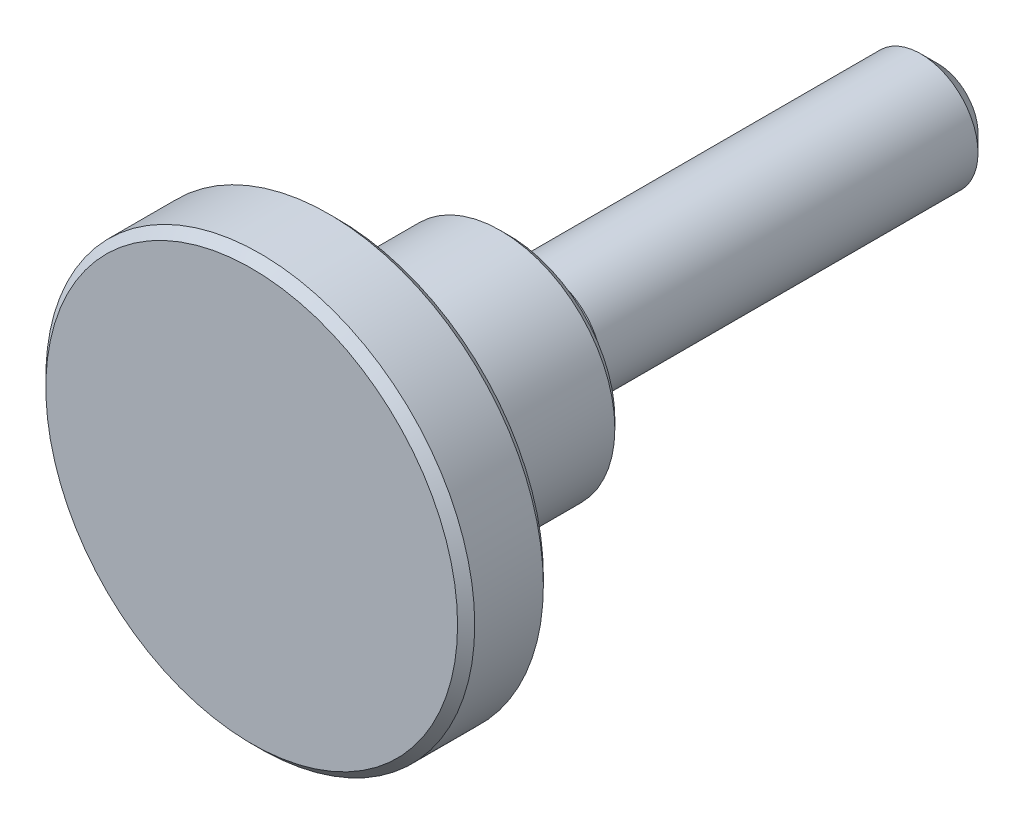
ISO-10303-21;
HEADER;
FILE_DESCRIPTION(('STEP AP214'),'2;1');
FILE_NAME('part.step','',(''),(''),'','','');
FILE_SCHEMA(('AUTOMOTIVE_DESIGN { 1 0 10303 214 1 1 1 1 }'));
ENDSEC;
DATA;
#1=APPLICATION_CONTEXT('core data for automotive mechanical design processes');
#2=APPLICATION_PROTOCOL_DEFINITION('international standard','automotive_design',2000,#1);
#3=PRODUCT_CONTEXT('',#1,'mechanical');
#4=PRODUCT('Part','Part','',(#3));
#5=PRODUCT_RELATED_PRODUCT_CATEGORY('part','',(#4));
#6=PRODUCT_DEFINITION_FORMATION('','',#4);
#7=PRODUCT_DEFINITION_CONTEXT('part definition',#1,'design');
#8=PRODUCT_DEFINITION('design','',#6,#7);
#9=PRODUCT_DEFINITION_SHAPE('','',#8);
#10=(LENGTH_UNIT() NAMED_UNIT(*) SI_UNIT(.MILLI.,.METRE.));
#11=(NAMED_UNIT(*) PLANE_ANGLE_UNIT() SI_UNIT($,.RADIAN.));
#12=(NAMED_UNIT(*) SI_UNIT($,.STERADIAN.) SOLID_ANGLE_UNIT());
#13=UNCERTAINTY_MEASURE_WITH_UNIT(LENGTH_MEASURE(1.E-05),#10,'distance_accuracy_value','');
#14=(GEOMETRIC_REPRESENTATION_CONTEXT(3) GLOBAL_UNCERTAINTY_ASSIGNED_CONTEXT((#13)) GLOBAL_UNIT_ASSIGNED_CONTEXT((#10,
#11,#12)) REPRESENTATION_CONTEXT('',''));
#15=CARTESIAN_POINT('',(0.,0.,0.));
#16=DIRECTION('',(0.,0.,1.));
#17=DIRECTION('',(1.,0.,0.));
#18=AXIS2_PLACEMENT_3D('',#15,#16,#17);
#19=CARTESIAN_POINT('',(0.,2.8,-30.));
#20=DIRECTION('',(0.,0.,1.));
#21=DIRECTION('',(1.,0.,0.));
#22=AXIS2_PLACEMENT_3D('',#19,#20,#21);
#23=PLANE('',#22);
#24=CARTESIAN_POINT('',(0.,0.,-30.));
#25=DIRECTION('',(0.,0.,1.));
#26=DIRECTION('',(1.,0.,0.));
#27=AXIS2_PLACEMENT_3D('',#24,#25,#26);
#28=CIRCLE('',#27,2.8);
#29=CARTESIAN_POINT('',(2.8,0.,-30.));
#30=VERTEX_POINT('',#29);
#31=EDGE_CURVE('E8',#30,#30,#28,.T.);
#32=ORIENTED_EDGE('',*,*,#31,.F.);
#33=EDGE_LOOP('',(#32));
#34=FACE_BOUND('',#33,.T.);
#35=ADVANCED_FACE('F12',(#34),#23,.F.);
#36=CARTESIAN_POINT('',(0.,0.,-30.));
#37=DIRECTION('',(0.,0.,1.));
#38=DIRECTION('',(1.,0.,0.));
#39=AXIS2_PLACEMENT_3D('',#36,#37,#38);
#40=CONICAL_SURFACE('',#39,2.8,0.785398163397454);
#41=CARTESIAN_POINT('',(0.,0.,-28.8));
#42=DIRECTION('',(0.,0.,1.));
#43=DIRECTION('',(1.,0.,0.));
#44=AXIS2_PLACEMENT_3D('',#41,#42,#43);
#45=CIRCLE('',#44,4.);
#46=CARTESIAN_POINT('',(4.,0.,-28.8));
#47=VERTEX_POINT('',#46);
#48=EDGE_CURVE('E18',#47,#47,#45,.T.);
#49=ORIENTED_EDGE('',*,*,#48,.F.);
#50=EDGE_LOOP('',(#49));
#51=FACE_BOUND('',#50,.T.);
#52=ORIENTED_EDGE('',*,*,#31,.T.);
#53=EDGE_LOOP('',(#52));
#54=FACE_BOUND('',#53,.T.);
#55=ADVANCED_FACE('F141',(#51,#54),#40,.T.);
#56=CARTESIAN_POINT('',(0.,0.,23.));
#57=DIRECTION('',(0.,0.,1.));
#58=DIRECTION('',(1.,0.,0.));
#59=AXIS2_PLACEMENT_3D('',#56,#57,#58);
#60=CYLINDRICAL_SURFACE('',#59,4.);
#61=CARTESIAN_POINT('',(0.,0.,-2.5));
#62=DIRECTION('',(0.,0.,1.));
#63=DIRECTION('',(1.,0.,0.));
#64=AXIS2_PLACEMENT_3D('',#61,#62,#63);
#65=CIRCLE('',#64,4.);
#66=CARTESIAN_POINT('',(4.,0.,-2.5));
#67=VERTEX_POINT('',#66);
#68=EDGE_CURVE('E22',#67,#67,#65,.T.);
#69=ORIENTED_EDGE('',*,*,#68,.F.);
#70=EDGE_LOOP('',(#69));
#71=FACE_BOUND('',#70,.T.);
#72=ORIENTED_EDGE('',*,*,#48,.T.);
#73=EDGE_LOOP('',(#72));
#74=FACE_BOUND('',#73,.T.);
#75=ADVANCED_FACE('F136',(#71,#74),#60,.T.);
#76=CARTESIAN_POINT('',(0.,4.,-2.5));
#77=DIRECTION('',(0.,0.,-1.));
#78=DIRECTION('',(-1.,0.,0.));
#79=AXIS2_PLACEMENT_3D('',#76,#77,#78);
#80=PLANE('',#79);
#81=CARTESIAN_POINT('',(0.,0.,-2.5));
#82=DIRECTION('',(0.,0.,1.));
#83=DIRECTION('',(1.,0.,0.));
#84=AXIS2_PLACEMENT_3D('',#81,#82,#83);
#85=CIRCLE('',#84,3.59999999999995);
#86=CARTESIAN_POINT('',(3.59999999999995,0.,-2.5));
#87=VERTEX_POINT('',#86);
#88=EDGE_CURVE('E26',#87,#87,#85,.T.);
#89=ORIENTED_EDGE('',*,*,#88,.F.);
#90=EDGE_LOOP('',(#89));
#91=FACE_BOUND('',#90,.T.);
#92=ORIENTED_EDGE('',*,*,#68,.T.);
#93=EDGE_LOOP('',(#92));
#94=FACE_BOUND('',#93,.T.);
#95=ADVANCED_FACE('F130',(#91,#94),#80,.F.);
#96=CARTESIAN_POINT('',(0.,0.,-1.9));
#97=DIRECTION('',(0.,0.,1.));
#98=DIRECTION('',(1.,0.,0.));
#99=AXIS2_PLACEMENT_3D('',#96,#97,#98);
#100=TOROIDAL_SURFACE('',#99,3.6,0.6);
#101=CARTESIAN_POINT('',(0.,0.,-1.9));
#102=DIRECTION('',(0.,0.,1.));
#103=DIRECTION('',(1.,0.,0.));
#104=AXIS2_PLACEMENT_3D('',#101,#102,#103);
#105=CIRCLE('',#104,3.);
#106=CARTESIAN_POINT('',(3.,0.,-1.9));
#107=VERTEX_POINT('',#106);
#108=EDGE_CURVE('E31',#107,#107,#105,.T.);
#109=ORIENTED_EDGE('',*,*,#108,.F.);
#110=EDGE_LOOP('',(#109));
#111=FACE_BOUND('',#110,.T.);
#112=ORIENTED_EDGE('',*,*,#88,.T.);
#113=EDGE_LOOP('',(#112));
#114=FACE_BOUND('',#113,.T.);
#115=ADVANCED_FACE('F124',(#111,#114),#100,.F.);
#116=CARTESIAN_POINT('',(0.,0.,23.));
#117=DIRECTION('',(0.,0.,1.));
#118=DIRECTION('',(1.,0.,0.));
#119=AXIS2_PLACEMENT_3D('',#116,#117,#118);
#120=CYLINDRICAL_SURFACE('',#119,3.);
#121=CARTESIAN_POINT('',(0.,0.,-0.600000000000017));
#122=DIRECTION('',(0.,0.,1.));
#123=DIRECTION('',(1.,0.,0.));
#124=AXIS2_PLACEMENT_3D('',#121,#122,#123);
#125=CIRCLE('',#124,3.);
#126=CARTESIAN_POINT('',(3.,0.,-0.600000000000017));
#127=VERTEX_POINT('',#126);
#128=EDGE_CURVE('E34',#127,#127,#125,.T.);
#129=ORIENTED_EDGE('',*,*,#128,.F.);
#130=EDGE_LOOP('',(#129));
#131=FACE_BOUND('',#130,.T.);
#132=ORIENTED_EDGE('',*,*,#108,.T.);
#133=EDGE_LOOP('',(#132));
#134=FACE_BOUND('',#133,.T.);
#135=ADVANCED_FACE('F118',(#131,#134),#120,.T.);
#136=CARTESIAN_POINT('',(0.,0.,-0.600000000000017));
#137=DIRECTION('',(0.,0.,1.));
#138=DIRECTION('',(1.,0.,0.));
#139=AXIS2_PLACEMENT_3D('',#136,#137,#138);
#140=TOROIDAL_SURFACE('',#139,3.6,0.600000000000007);
#141=CARTESIAN_POINT('',(0.,0.,0.));
#142=DIRECTION('',(0.,0.,1.));
#143=DIRECTION('',(1.,0.,0.));
#144=AXIS2_PLACEMENT_3D('',#141,#142,#143);
#145=CIRCLE('',#144,3.6);
#146=CARTESIAN_POINT('',(3.6,0.,0.));
#147=VERTEX_POINT('',#146);
#148=EDGE_CURVE('E37',#147,#147,#145,.T.);
#149=ORIENTED_EDGE('',*,*,#148,.F.);
#150=EDGE_LOOP('',(#149));
#151=FACE_BOUND('',#150,.T.);
#152=ORIENTED_EDGE('',*,*,#128,.T.);
#153=EDGE_LOOP('',(#152));
#154=FACE_BOUND('',#153,.T.);
#155=ADVANCED_FACE('F112',(#151,#154),#140,.F.);
#156=CARTESIAN_POINT('',(0.,7.4,0.));
#157=DIRECTION('',(0.,0.,1.));
#158=DIRECTION('',(1.,0.,0.));
#159=AXIS2_PLACEMENT_3D('',#156,#157,#158);
#160=PLANE('',#159);
#161=CARTESIAN_POINT('',(0.,0.,0.));
#162=DIRECTION('',(0.,0.,1.));
#163=DIRECTION('',(1.,0.,0.));
#164=AXIS2_PLACEMENT_3D('',#161,#162,#163);
#165=CIRCLE('',#164,7.4);
#166=CARTESIAN_POINT('',(7.4,0.,0.));
#167=VERTEX_POINT('',#166);
#168=EDGE_CURVE('E40',#167,#167,#165,.T.);
#169=ORIENTED_EDGE('',*,*,#168,.F.);
#170=EDGE_LOOP('',(#169));
#171=FACE_BOUND('',#170,.T.);
#172=ORIENTED_EDGE('',*,*,#148,.T.);
#173=EDGE_LOOP('',(#172));
#174=FACE_BOUND('',#173,.T.);
#175=ADVANCED_FACE('F106',(#171,#174),#160,.F.);
#176=CARTESIAN_POINT('',(0.,0.,0.));
#177=DIRECTION('',(0.,0.,1.));
#178=DIRECTION('',(1.,0.,0.));
#179=AXIS2_PLACEMENT_3D('',#176,#177,#178);
#180=CONICAL_SURFACE('',#179,7.4,0.785398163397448);
#181=CARTESIAN_POINT('',(0.,0.,0.599999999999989));
#182=DIRECTION('',(0.,0.,1.));
#183=DIRECTION('',(1.,0.,0.));
#184=AXIS2_PLACEMENT_3D('',#181,#182,#183);
#185=CIRCLE('',#184,8.);
#186=CARTESIAN_POINT('',(8.,0.,0.599999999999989));
#187=VERTEX_POINT('',#186);
#188=EDGE_CURVE('E43',#187,#187,#185,.T.);
#189=ORIENTED_EDGE('',*,*,#188,.F.);
#190=EDGE_LOOP('',(#189));
#191=FACE_BOUND('',#190,.T.);
#192=ORIENTED_EDGE('',*,*,#168,.T.);
#193=EDGE_LOOP('',(#192));
#194=FACE_BOUND('',#193,.T.);
#195=ADVANCED_FACE('F100',(#191,#194),#180,.T.);
#196=CARTESIAN_POINT('',(0.,0.,23.));
#197=DIRECTION('',(0.,0.,1.));
#198=DIRECTION('',(1.,0.,0.));
#199=AXIS2_PLACEMENT_3D('',#196,#197,#198);
#200=CYLINDRICAL_SURFACE('',#199,8.);
#201=CARTESIAN_POINT('',(0.,0.,10.));
#202=DIRECTION('',(0.,0.,1.));
#203=DIRECTION('',(1.,0.,0.));
#204=AXIS2_PLACEMENT_3D('',#201,#202,#203);
#205=CIRCLE('',#204,8.);
#206=CARTESIAN_POINT('',(8.,0.,10.));
#207=VERTEX_POINT('',#206);
#208=EDGE_CURVE('E46',#207,#207,#205,.T.);
#209=ORIENTED_EDGE('',*,*,#208,.F.);
#210=EDGE_LOOP('',(#209));
#211=FACE_BOUND('',#210,.T.);
#212=ORIENTED_EDGE('',*,*,#188,.T.);
#213=EDGE_LOOP('',(#212));
#214=FACE_BOUND('',#213,.T.);
#215=ADVANCED_FACE('F94',(#211,#214),#200,.T.);
#216=CARTESIAN_POINT('',(0.,0.,10.));
#217=DIRECTION('',(0.,0.,1.));
#218=DIRECTION('',(1.,0.,0.));
#219=AXIS2_PLACEMENT_3D('',#216,#217,#218);
#220=TOROIDAL_SURFACE('',#219,10.,2.);
#221=CARTESIAN_POINT('',(0.,0.,12.));
#222=DIRECTION('',(0.,0.,1.));
#223=DIRECTION('',(1.,0.,0.));
#224=AXIS2_PLACEMENT_3D('',#221,#222,#223);
#225=CIRCLE('',#224,10.);
#226=CARTESIAN_POINT('',(10.,0.,12.));
#227=VERTEX_POINT('',#226);
#228=EDGE_CURVE('E49',#227,#227,#225,.T.);
#229=ORIENTED_EDGE('',*,*,#228,.F.);
#230=EDGE_LOOP('',(#229));
#231=FACE_BOUND('',#230,.T.);
#232=ORIENTED_EDGE('',*,*,#208,.T.);
#233=EDGE_LOOP('',(#232));
#234=FACE_BOUND('',#233,.T.);
#235=ADVANCED_FACE('F88',(#231,#234),#220,.F.);
#236=CARTESIAN_POINT('',(0.,14.4,12.));
#237=DIRECTION('',(0.,0.,1.));
#238=DIRECTION('',(1.,0.,0.));
#239=AXIS2_PLACEMENT_3D('',#236,#237,#238);
#240=PLANE('',#239);
#241=CARTESIAN_POINT('',(0.,0.,12.));
#242=DIRECTION('',(0.,0.,1.));
#243=DIRECTION('',(1.,0.,0.));
#244=AXIS2_PLACEMENT_3D('',#241,#242,#243);
#245=CIRCLE('',#244,14.4);
#246=CARTESIAN_POINT('',(14.4,0.,12.));
#247=VERTEX_POINT('',#246);
#248=EDGE_CURVE('E52',#247,#247,#245,.T.);
#249=ORIENTED_EDGE('',*,*,#248,.F.);
#250=EDGE_LOOP('',(#249));
#251=FACE_BOUND('',#250,.T.);
#252=ORIENTED_EDGE('',*,*,#228,.T.);
#253=EDGE_LOOP('',(#252));
#254=FACE_BOUND('',#253,.T.);
#255=ADVANCED_FACE('F82',(#251,#254),#240,.F.);
#256=CARTESIAN_POINT('',(0.,0.,12.));
#257=DIRECTION('',(0.,0.,1.));
#258=DIRECTION('',(1.,0.,0.));
#259=AXIS2_PLACEMENT_3D('',#256,#257,#258);
#260=CONICAL_SURFACE('',#259,14.4,0.78539816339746);
#261=CARTESIAN_POINT('',(0.,0.,12.6));
#262=DIRECTION('',(0.,0.,1.));
#263=DIRECTION('',(1.,0.,0.));
#264=AXIS2_PLACEMENT_3D('',#261,#262,#263);
#265=CIRCLE('',#264,15.);
#266=CARTESIAN_POINT('',(15.,0.,12.6));
#267=VERTEX_POINT('',#266);
#268=EDGE_CURVE('E55',#267,#267,#265,.T.);
#269=ORIENTED_EDGE('',*,*,#268,.F.);
#270=EDGE_LOOP('',(#269));
#271=FACE_BOUND('',#270,.T.);
#272=ORIENTED_EDGE('',*,*,#248,.T.);
#273=EDGE_LOOP('',(#272));
#274=FACE_BOUND('',#273,.T.);
#275=ADVANCED_FACE('F76',(#271,#274),#260,.T.);
#276=CARTESIAN_POINT('',(0.,0.,23.));
#277=DIRECTION('',(0.,0.,1.));
#278=DIRECTION('',(1.,0.,0.));
#279=AXIS2_PLACEMENT_3D('',#276,#277,#278);
#280=CYLINDRICAL_SURFACE('',#279,15.);
#281=CARTESIAN_POINT('',(0.,0.,17.4));
#282=DIRECTION('',(0.,0.,1.));
#283=DIRECTION('',(1.,0.,0.));
#284=AXIS2_PLACEMENT_3D('',#281,#282,#283);
#285=CIRCLE('',#284,15.);
#286=CARTESIAN_POINT('',(15.,0.,17.4));
#287=VERTEX_POINT('',#286);
#288=EDGE_CURVE('E58',#287,#287,#285,.T.);
#289=ORIENTED_EDGE('',*,*,#288,.F.);
#290=EDGE_LOOP('',(#289));
#291=FACE_BOUND('',#290,.T.);
#292=ORIENTED_EDGE('',*,*,#268,.T.);
#293=EDGE_LOOP('',(#292));
#294=FACE_BOUND('',#293,.T.);
#295=ADVANCED_FACE('F70',(#291,#294),#280,.T.);
#296=CARTESIAN_POINT('',(0.,0.,17.4));
#297=DIRECTION('',(0.,0.,-1.));
#298=DIRECTION('',(-1.,0.,0.));
#299=AXIS2_PLACEMENT_3D('',#296,#297,#298);
#300=CONICAL_SURFACE('',#299,15.,0.78539816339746);
#301=CARTESIAN_POINT('',(0.,0.,18.));
#302=DIRECTION('',(0.,0.,1.));
#303=DIRECTION('',(1.,0.,0.));
#304=AXIS2_PLACEMENT_3D('',#301,#302,#303);
#305=CIRCLE('',#304,14.4);
#306=CARTESIAN_POINT('',(14.4,0.,18.));
#307=VERTEX_POINT('',#306);
#308=EDGE_CURVE('E61',#307,#307,#305,.T.);
#309=ORIENTED_EDGE('',*,*,#308,.F.);
#310=EDGE_LOOP('',(#309));
#311=FACE_BOUND('',#310,.T.);
#312=ORIENTED_EDGE('',*,*,#288,.T.);
#313=EDGE_LOOP('',(#312));
#314=FACE_BOUND('',#313,.T.);
#315=ADVANCED_FACE('F67',(#311,#314),#300,.T.);
#316=CARTESIAN_POINT('',(0.,14.4,18.));
#317=DIRECTION('',(0.,0.,-1.));
#318=DIRECTION('',(-1.,0.,0.));
#319=AXIS2_PLACEMENT_3D('',#316,#317,#318);
#320=PLANE('',#319);
#321=ORIENTED_EDGE('',*,*,#308,.T.);
#322=EDGE_LOOP('',(#321));
#323=FACE_BOUND('',#322,.T.);
#324=ADVANCED_FACE('F65',(#323),#320,.F.);
#325=CLOSED_SHELL('',(#35,#55,#75,#95,#115,#135,#155,#175,#195,#215,#235,#255,#275,#295,#315,#324));
#326=MANIFOLD_SOLID_BREP('B1',#325);
#327=ADVANCED_BREP_SHAPE_REPRESENTATION('',(#18,#326),#14);
#328=SHAPE_DEFINITION_REPRESENTATION(#9,#327);
ENDSEC;
END-ISO-10303-21;
